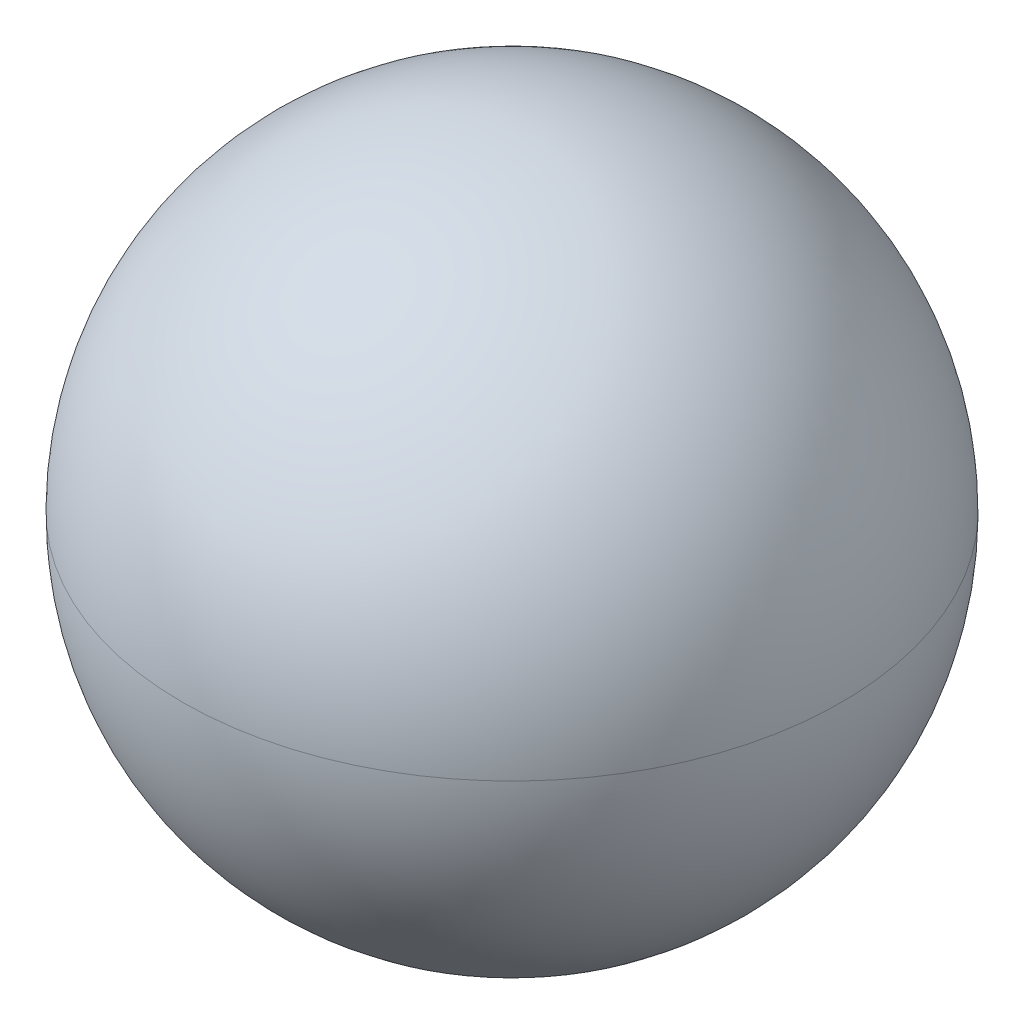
ISO-10303-21;
HEADER;
FILE_DESCRIPTION(('STEP AP214'),'2;1');
FILE_NAME('part.step','',(''),(''),'','','');
FILE_SCHEMA(('AUTOMOTIVE_DESIGN { 1 0 10303 214 1 1 1 1 }'));
ENDSEC;
DATA;
#1=APPLICATION_CONTEXT('core data for automotive mechanical design processes');
#2=APPLICATION_PROTOCOL_DEFINITION('international standard','automotive_design',2000,#1);
#3=PRODUCT_CONTEXT('',#1,'mechanical');
#4=PRODUCT('Part','Part','',(#3));
#5=PRODUCT_RELATED_PRODUCT_CATEGORY('part','',(#4));
#6=PRODUCT_DEFINITION_FORMATION('','',#4);
#7=PRODUCT_DEFINITION_CONTEXT('part definition',#1,'design');
#8=PRODUCT_DEFINITION('design','',#6,#7);
#9=PRODUCT_DEFINITION_SHAPE('','',#8);
#10=(LENGTH_UNIT() NAMED_UNIT(*) SI_UNIT(.MILLI.,.METRE.));
#11=(NAMED_UNIT(*) PLANE_ANGLE_UNIT() SI_UNIT($,.RADIAN.));
#12=(NAMED_UNIT(*) SI_UNIT($,.STERADIAN.) SOLID_ANGLE_UNIT());
#13=UNCERTAINTY_MEASURE_WITH_UNIT(LENGTH_MEASURE(1.E-05),#10,'distance_accuracy_value','');
#14=(GEOMETRIC_REPRESENTATION_CONTEXT(3) GLOBAL_UNCERTAINTY_ASSIGNED_CONTEXT((#13)) GLOBAL_UNIT_ASSIGNED_CONTEXT((#10,
#11,#12)) REPRESENTATION_CONTEXT('',''));
#15=CARTESIAN_POINT('',(0.,0.,0.));
#16=DIRECTION('',(0.,0.,1.));
#17=DIRECTION('',(1.,0.,0.));
#18=AXIS2_PLACEMENT_3D('',#15,#16,#17);
#19=CARTESIAN_POINT('',(0.,21.5,0.));
#20=DIRECTION('',(0.,1.,0.));
#21=DIRECTION('',(0.,0.,1.));
#22=AXIS2_PLACEMENT_3D('',#19,#20,#21);
#23=SPHERICAL_SURFACE('',#22,21.5);
#24=CARTESIAN_POINT('',(0.,21.5,0.));
#25=DIRECTION('',(0.,-1.,0.));
#26=DIRECTION('',(0.,0.,-1.));
#27=AXIS2_PLACEMENT_3D('',#24,#25,#26);
#28=CIRCLE('',#27,21.5);
#29=CARTESIAN_POINT('',(0.,21.5,-21.5));
#30=VERTEX_POINT('',#29);
#31=EDGE_CURVE('E10',#30,#30,#28,.T.);
#32=ORIENTED_EDGE('',*,*,#31,.F.);
#33=EDGE_LOOP('',(#32));
#34=FACE_BOUND('',#33,.T.);
#35=ADVANCED_FACE('F34',(#34),#23,.T.);
#36=CARTESIAN_POINT('',(0.,21.5,0.));
#37=DIRECTION('',(0.,1.,0.));
#38=DIRECTION('',(0.,0.,1.));
#39=AXIS2_PLACEMENT_3D('',#36,#37,#38);
#40=SPHERICAL_SURFACE('',#39,21.5);
#41=ORIENTED_EDGE('',*,*,#31,.T.);
#42=EDGE_LOOP('',(#41));
#43=FACE_BOUND('',#42,.T.);
#44=ADVANCED_FACE('F41',(#43),#40,.T.);
#45=CLOSED_SHELL('',(#35,#44));
#46=MANIFOLD_SOLID_BREP('B2',#45);
#47=ADVANCED_BREP_SHAPE_REPRESENTATION('',(#18,#46),#14);
#48=SHAPE_DEFINITION_REPRESENTATION(#9,#47);
ENDSEC;
END-ISO-10303-21;
